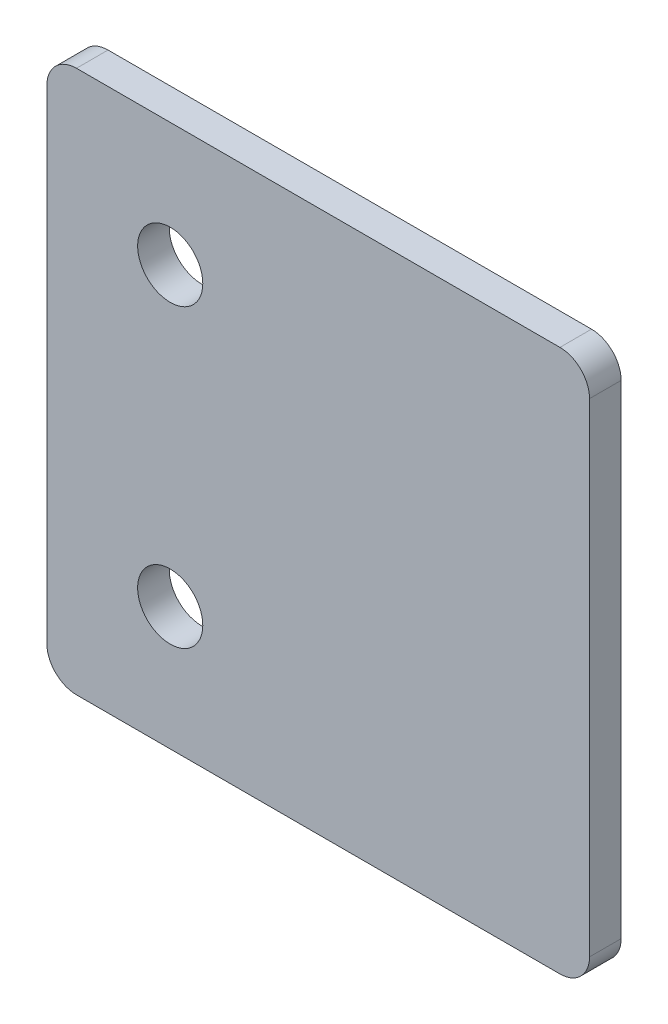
from build123d import *

# Parameters (mm, degrees)
EXTRUDE_1_DEPTH             = 3.2
HOLE_WIZARD_6_6_6_6_1_D     = 6.6
HOLE_WIZARD_6_6_6_6_1_DEPTH = 60
HOLE_WIZARD_6_6_6_6_1_TIP   = 1.982840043


with BuildPart() as part:
    # Sketch 1 → Extrude 1 (new body)
    with BuildSketch(Plane.XY):
        with BuildLine():
            Line((3, 0), (52, 0))
            ThreePointArc((52, 0), (54.121320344, 0.878679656), (55, 3))
            Line((55, 3), (55, 52))
            ThreePointArc((55, 52), (54.121320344, 54.121320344), (52, 55))
            Line((52, 55), (3, 55))
            ThreePointArc((3, 55), (0.878679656, 54.121320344), (0, 52))
            Line((0, 52), (0, 3))
            ThreePointArc((0, 3), (0.878679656, 0.878679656), (3, 0))
        make_face()
    extrude(amount=EXTRUDE_1_DEPTH)

    # Hole Wizard 6.6 _6.6_ _1
    with Locations(Plane(origin=(12.5, 42.5, 3.2), x_dir=(1, 0, 0), z_dir=(0, 0, 1))):
        with Locations((0, 0), (0, -30)):
            Hole(HOLE_WIZARD_6_6_6_6_1_D / 2, depth=HOLE_WIZARD_6_6_6_6_1_DEPTH)
            with Locations((0, 0, -(HOLE_WIZARD_6_6_6_6_1_DEPTH + HOLE_WIZARD_6_6_6_6_1_TIP / 2))):  # 118° drill point
                Cone(0, HOLE_WIZARD_6_6_6_6_1_D / 2, HOLE_WIZARD_6_6_6_6_1_TIP, mode=Mode.SUBTRACT)


solid = part.part
